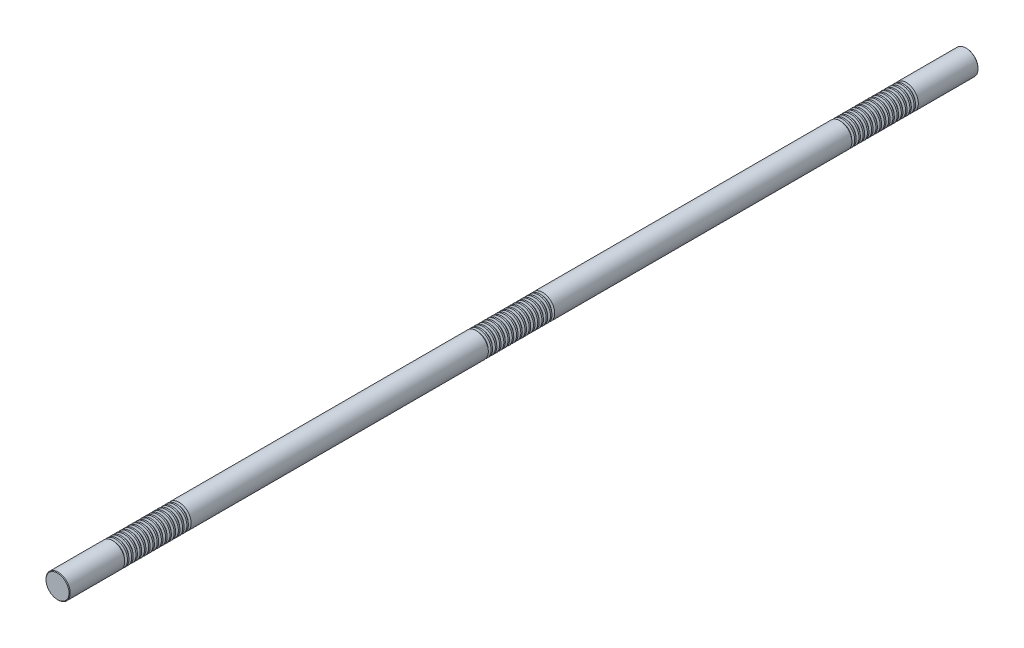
from build123d import *

# Parameters (mm, degrees)
SKETCH1_R           = 20
BOSS_EXTRUDE1_DEPTH = 750
CHAMFER1_SIZE       = 1
LPATTERN1_COUNT     = 16
LPATTERN1_PITCH     = 7
LPATTERN2_COUNT     = 3
LPATTERN2_PITCH     = 600


with BuildPart() as part:
    # Sketch1 → Boss-Extrude1 (new, symmetric)
    with BuildSketch(Plane.XY):
        Circle(SKETCH1_R)
    extrude(amount=BOSS_EXTRUDE1_DEPTH, both=True)

    # Chamfer1
    chamfer1_edges = [part.edges().sort_by_distance(p)[0] for p in [
        (-20, 0, -750),
        (-20, 0, 750),
    ]]
    chamfer(chamfer1_edges, length=CHAMFER1_SIZE)

    # Sketch2 → Cut-Revolve1 (revolve, cut)
    with BuildSketch(Plane(origin=(0, 0, 0), x_dir=(0, 0, -1), z_dir=(1, 0, 0)), mode=Mode.PRIVATE) as cut_revolve1_sk:
        Polygon((650.535898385, 20), (645.964101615, 20), (647.035898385, 16), (649.464101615, 16), align=None)
    cut_revolve1 = revolve(cut_revolve1_sk.sketch.rotate(Axis((0, 0, 750), (0, 0, -1)), 90), axis=Axis((0, 0, 750), (0, 0, -1)), mode=Mode.SUBTRACT)

    # LPattern1: Cut-Revolve1 ×16
    with Locations(*[(0, 0, i * LPATTERN1_PITCH) for i in range(1, LPATTERN1_COUNT)]):
        add(cut_revolve1, mode=Mode.SUBTRACT)

    # LPattern2: Cut-Revolve1 ×3
    with Locations(*[(0, 0, i * LPATTERN2_PITCH) for i in range(1, LPATTERN2_COUNT)]):
        add(cut_revolve1, mode=Mode.SUBTRACT)

    # LPattern2 copy 1 sketch → LPattern2 copy 1 (revolve, cut)
    with BuildSketch(Plane(origin=(0, 0, 607), x_dir=(0, 0, -1), z_dir=(1, 0, 0))):
        Polygon((650.535898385, 20), (645.964101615, 20), (647.035898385, 16), (649.464101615, 16), align=None)
    revolve(axis=Axis((0, 0, 1357), (0, 0, -1)), mode=Mode.SUBTRACT)

    # LPattern2 copy 2 sketch → LPattern2 copy 2 (revolve, cut)
    with BuildSketch(Plane(origin=(0, 0, 1207), x_dir=(0, 0, -1), z_dir=(1, 0, 0))):
        Polygon((650.535898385, 20), (645.964101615, 20), (647.035898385, 16), (649.464101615, 16), align=None)
    revolve(axis=Axis((0, 0, 1957), (0, 0, -1)), mode=Mode.SUBTRACT)

    # LPattern2 copy 3 sketch → LPattern2 copy 3 (revolve, cut)
    with BuildSketch(Plane(origin=(0, 0, 614), x_dir=(0, 0, -1), z_dir=(1, 0, 0))):
        Polygon((650.535898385, 20), (645.964101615, 20), (647.035898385, 16), (649.464101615, 16), align=None)
    revolve(axis=Axis((0, 0, 1364), (0, 0, -1)), mode=Mode.SUBTRACT)

    # LPattern2 copy 4 sketch → LPattern2 copy 4 (revolve, cut)
    with BuildSketch(Plane(origin=(0, 0, 1214), x_dir=(0, 0, -1), z_dir=(1, 0, 0))):
        Polygon((650.535898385, 20), (645.964101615, 20), (647.035898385, 16), (649.464101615, 16), align=None)
    revolve(axis=Axis((0, 0, 1964), (0, 0, -1)), mode=Mode.SUBTRACT)

    # LPattern2 copy 5 sketch → LPattern2 copy 5 (revolve, cut)
    with BuildSketch(Plane(origin=(0, 0, 621), x_dir=(0, 0, -1), z_dir=(1, 0, 0))):
        Polygon((650.535898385, 20), (645.964101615, 20), (647.035898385, 16), (649.464101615, 16), align=None)
    revolve(axis=Axis((0, 0, 1371), (0, 0, -1)), mode=Mode.SUBTRACT)

    # LPattern2 copy 6 sketch → LPattern2 copy 6 (revolve, cut)
    with BuildSketch(Plane(origin=(0, 0, 1221), x_dir=(0, 0, -1), z_dir=(1, 0, 0))):
        Polygon((650.535898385, 20), (645.964101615, 20), (647.035898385, 16), (649.464101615, 16), align=None)
    revolve(axis=Axis((0, 0, 1971), (0, 0, -1)), mode=Mode.SUBTRACT)

    # LPattern2 copy 7 sketch → LPattern2 copy 7 (revolve, cut)
    with BuildSketch(Plane(origin=(0, 0, 628), x_dir=(0, 0, -1), z_dir=(1, 0, 0))):
        Polygon((650.535898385, 20), (645.964101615, 20), (647.035898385, 16), (649.464101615, 16), align=None)
    revolve(axis=Axis((0, 0, 1378), (0, 0, -1)), mode=Mode.SUBTRACT)

    # LPattern2 copy 8 sketch → LPattern2 copy 8 (revolve, cut)
    with BuildSketch(Plane(origin=(0, 0, 1228), x_dir=(0, 0, -1), z_dir=(1, 0, 0))):
        Polygon((650.535898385, 20), (645.964101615, 20), (647.035898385, 16), (649.464101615, 16), align=None)
    revolve(axis=Axis((0, 0, 1978), (0, 0, -1)), mode=Mode.SUBTRACT)

    # LPattern2 copy 9 sketch → LPattern2 copy 9 (revolve, cut)
    with BuildSketch(Plane(origin=(0, 0, 635), x_dir=(0, 0, -1), z_dir=(1, 0, 0))):
        Polygon((650.535898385, 20), (645.964101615, 20), (647.035898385, 16), (649.464101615, 16), align=None)
    revolve(axis=Axis((0, 0, 1385), (0, 0, -1)), mode=Mode.SUBTRACT)

    # LPattern2 copy 10 sketch → LPattern2 copy 10 (revolve, cut)
    with BuildSketch(Plane(origin=(0, 0, 1235), x_dir=(0, 0, -1), z_dir=(1, 0, 0))):
        Polygon((650.535898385, 20), (645.964101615, 20), (647.035898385, 16), (649.464101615, 16), align=None)
    revolve(axis=Axis((0, 0, 1985), (0, 0, -1)), mode=Mode.SUBTRACT)

    # LPattern2 copy 11 sketch → LPattern2 copy 11 (revolve, cut)
    with BuildSketch(Plane(origin=(0, 0, 642), x_dir=(0, 0, -1), z_dir=(1, 0, 0))):
        Polygon((650.535898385, 20), (645.964101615, 20), (647.035898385, 16), (649.464101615, 16), align=None)
    revolve(axis=Axis((0, 0, 1392), (0, 0, -1)), mode=Mode.SUBTRACT)

    # LPattern2 copy 12 sketch → LPattern2 copy 12 (revolve, cut)
    with BuildSketch(Plane(origin=(0, 0, 1242), x_dir=(0, 0, -1), z_dir=(1, 0, 0))):
        Polygon((650.535898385, 20), (645.964101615, 20), (647.035898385, 16), (649.464101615, 16), align=None)
    revolve(axis=Axis((0, 0, 1992), (0, 0, -1)), mode=Mode.SUBTRACT)

    # LPattern2 copy 13 sketch → LPattern2 copy 13 (revolve, cut)
    with BuildSketch(Plane(origin=(0, 0, 649), x_dir=(0, 0, -1), z_dir=(1, 0, 0))):
        Polygon((650.535898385, 20), (645.964101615, 20), (647.035898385, 16), (649.464101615, 16), align=None)
    revolve(axis=Axis((0, 0, 1399), (0, 0, -1)), mode=Mode.SUBTRACT)

    # LPattern2 copy 14 sketch → LPattern2 copy 14 (revolve, cut)
    with BuildSketch(Plane(origin=(0, 0, 1249), x_dir=(0, 0, -1), z_dir=(1, 0, 0))):
        Polygon((650.535898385, 20), (645.964101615, 20), (647.035898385, 16), (649.464101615, 16), align=None)
    revolve(axis=Axis((0, 0, 1999), (0, 0, -1)), mode=Mode.SUBTRACT)

    # LPattern2 copy 15 sketch → LPattern2 copy 15 (revolve, cut)
    with BuildSketch(Plane(origin=(0, 0, 656), x_dir=(0, 0, -1), z_dir=(1, 0, 0))):
        Polygon((650.535898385, 20), (645.964101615, 20), (647.035898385, 16), (649.464101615, 16), align=None)
    revolve(axis=Axis((0, 0, 1406), (0, 0, -1)), mode=Mode.SUBTRACT)

    # LPattern2 copy 16 sketch → LPattern2 copy 16 (revolve, cut)
    with BuildSketch(Plane(origin=(0, 0, 1256), x_dir=(0, 0, -1), z_dir=(1, 0, 0))):
        Polygon((650.535898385, 20), (645.964101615, 20), (647.035898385, 16), (649.464101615, 16), align=None)
    revolve(axis=Axis((0, 0, 2006), (0, 0, -1)), mode=Mode.SUBTRACT)

    # LPattern2 copy 17 sketch → LPattern2 copy 17 (revolve, cut)
    with BuildSketch(Plane(origin=(0, 0, 663), x_dir=(0, 0, -1), z_dir=(1, 0, 0))):
        Polygon((650.535898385, 20), (645.964101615, 20), (647.035898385, 16), (649.464101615, 16), align=None)
    revolve(axis=Axis((0, 0, 1413), (0, 0, -1)), mode=Mode.SUBTRACT)

    # LPattern2 copy 18 sketch → LPattern2 copy 18 (revolve, cut)
    with BuildSketch(Plane(origin=(0, 0, 1263), x_dir=(0, 0, -1), z_dir=(1, 0, 0))):
        Polygon((650.535898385, 20), (645.964101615, 20), (647.035898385, 16), (649.464101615, 16), align=None)
    revolve(axis=Axis((0, 0, 2013), (0, 0, -1)), mode=Mode.SUBTRACT)

    # LPattern2 copy 19 sketch → LPattern2 copy 19 (revolve, cut)
    with BuildSketch(Plane(origin=(0, 0, 670), x_dir=(0, 0, -1), z_dir=(1, 0, 0))):
        Polygon((650.535898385, 20), (645.964101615, 20), (647.035898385, 16), (649.464101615, 16), align=None)
    revolve(axis=Axis((0, 0, 1420), (0, 0, -1)), mode=Mode.SUBTRACT)

    # LPattern2 copy 20 sketch → LPattern2 copy 20 (revolve, cut)
    with BuildSketch(Plane(origin=(0, 0, 1270), x_dir=(0, 0, -1), z_dir=(1, 0, 0))):
        Polygon((650.535898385, 20), (645.964101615, 20), (647.035898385, 16), (649.464101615, 16), align=None)
    revolve(axis=Axis((0, 0, 2020), (0, 0, -1)), mode=Mode.SUBTRACT)

    # LPattern2 copy 21 sketch → LPattern2 copy 21 (revolve, cut)
    with BuildSketch(Plane(origin=(0, 0, 677), x_dir=(0, 0, -1), z_dir=(1, 0, 0))):
        Polygon((650.535898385, 20), (645.964101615, 20), (647.035898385, 16), (649.464101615, 16), align=None)
    revolve(axis=Axis((0, 0, 1427), (0, 0, -1)), mode=Mode.SUBTRACT)

    # LPattern2 copy 22 sketch → LPattern2 copy 22 (revolve, cut)
    with BuildSketch(Plane(origin=(0, 0, 1277), x_dir=(0, 0, -1), z_dir=(1, 0, 0))):
        Polygon((650.535898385, 20), (645.964101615, 20), (647.035898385, 16), (649.464101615, 16), align=None)
    revolve(axis=Axis((0, 0, 2027), (0, 0, -1)), mode=Mode.SUBTRACT)

    # LPattern2 copy 23 sketch → LPattern2 copy 23 (revolve, cut)
    with BuildSketch(Plane(origin=(0, 0, 684), x_dir=(0, 0, -1), z_dir=(1, 0, 0))):
        Polygon((650.535898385, 20), (645.964101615, 20), (647.035898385, 16), (649.464101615, 16), align=None)
    revolve(axis=Axis((0, 0, 1434), (0, 0, -1)), mode=Mode.SUBTRACT)

    # LPattern2 copy 24 sketch → LPattern2 copy 24 (revolve, cut)
    with BuildSketch(Plane(origin=(0, 0, 1284), x_dir=(0, 0, -1), z_dir=(1, 0, 0))):
        Polygon((650.535898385, 20), (645.964101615, 20), (647.035898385, 16), (649.464101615, 16), align=None)
    revolve(axis=Axis((0, 0, 2034), (0, 0, -1)), mode=Mode.SUBTRACT)

    # LPattern2 copy 25 sketch → LPattern2 copy 25 (revolve, cut)
    with BuildSketch(Plane(origin=(0, 0, 691), x_dir=(0, 0, -1), z_dir=(1, 0, 0))):
        Polygon((650.535898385, 20), (645.964101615, 20), (647.035898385, 16), (649.464101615, 16), align=None)
    revolve(axis=Axis((0, 0, 1441), (0, 0, -1)), mode=Mode.SUBTRACT)

    # LPattern2 copy 26 sketch → LPattern2 copy 26 (revolve, cut)
    with BuildSketch(Plane(origin=(0, 0, 1291), x_dir=(0, 0, -1), z_dir=(1, 0, 0))):
        Polygon((650.535898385, 20), (645.964101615, 20), (647.035898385, 16), (649.464101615, 16), align=None)
    revolve(axis=Axis((0, 0, 2041), (0, 0, -1)), mode=Mode.SUBTRACT)

    # LPattern2 copy 27 sketch → LPattern2 copy 27 (revolve, cut)
    with BuildSketch(Plane(origin=(0, 0, 698), x_dir=(0, 0, -1), z_dir=(1, 0, 0))):
        Polygon((650.535898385, 20), (645.964101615, 20), (647.035898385, 16), (649.464101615, 16), align=None)
    revolve(axis=Axis((0, 0, 1448), (0, 0, -1)), mode=Mode.SUBTRACT)

    # LPattern2 copy 28 sketch → LPattern2 copy 28 (revolve, cut)
    with BuildSketch(Plane(origin=(0, 0, 1298), x_dir=(0, 0, -1), z_dir=(1, 0, 0))):
        Polygon((650.535898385, 20), (645.964101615, 20), (647.035898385, 16), (649.464101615, 16), align=None)
    revolve(axis=Axis((0, 0, 2048), (0, 0, -1)), mode=Mode.SUBTRACT)

    # LPattern2 copy 29 sketch → LPattern2 copy 29 (revolve, cut)
    with BuildSketch(Plane(origin=(0, 0, 705), x_dir=(0, 0, -1), z_dir=(1, 0, 0))):
        Polygon((650.535898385, 20), (645.964101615, 20), (647.035898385, 16), (649.464101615, 16), align=None)
    revolve(axis=Axis((0, 0, 1455), (0, 0, -1)), mode=Mode.SUBTRACT)

    # LPattern2 copy 30 sketch → LPattern2 copy 30 (revolve, cut)
    with BuildSketch(Plane(origin=(0, 0, 1305), x_dir=(0, 0, -1), z_dir=(1, 0, 0))):
        Polygon((650.535898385, 20), (645.964101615, 20), (647.035898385, 16), (649.464101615, 16), align=None)
    revolve(axis=Axis((0, 0, 2055), (0, 0, -1)), mode=Mode.SUBTRACT)


solid = part.part
